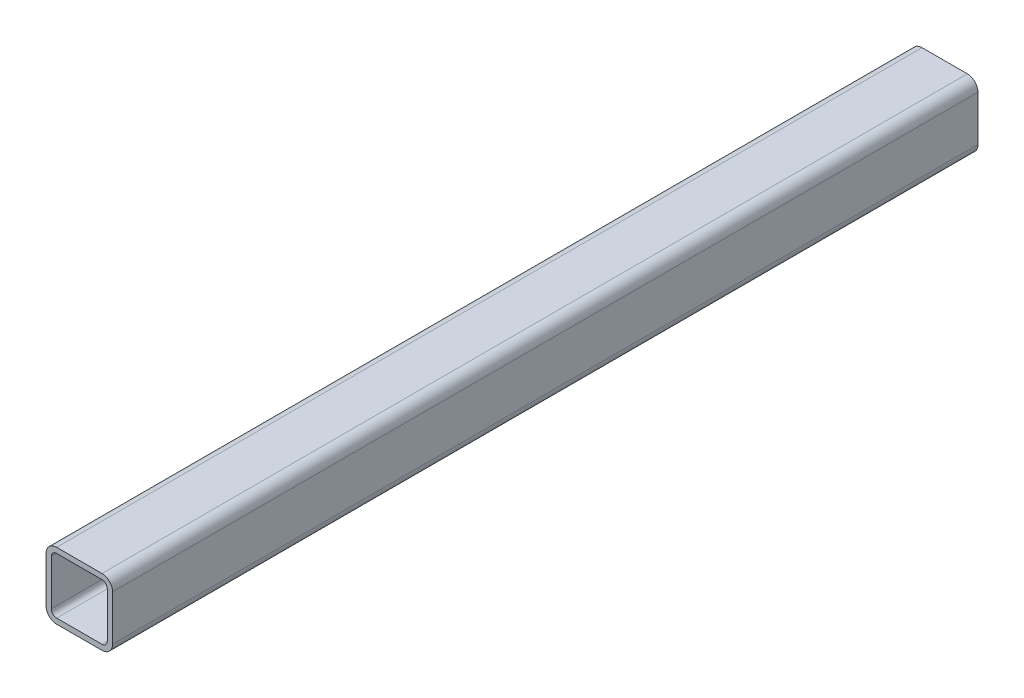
from build123d import *

# Parameters (mm, degrees)
EXTRUDE_THIN1_DEPTH = 247.65


with BuildPart() as part:
    # Sketch1 → Extrude-Thin1 (new, symmetric)
    with BuildSketch(Plane.XY):
        with BuildLine():
            Line((-19.05, -12.97432), (-19.05, 12.97432))
            ThreePointArc((-19.05, 12.97432), (-17.270474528, 17.270474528), (-12.97432, 19.05))
            Line((-12.97432, 19.05), (12.97432, 19.05))
            ThreePointArc((12.97432, 19.05), (17.270474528, 17.270474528), (19.05, 12.97432))
            Line((19.05, 12.97432), (19.05, -12.97432))
            ThreePointArc((19.05, -12.97432), (17.270474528, -17.270474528), (12.97432, -19.05))
            Line((12.97432, -19.05), (-12.97432, -19.05))
            ThreePointArc((-12.97432, -19.05), (-17.270474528, -17.270474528), (-19.05, -12.97432))
        make_face()
        with BuildLine():
            Line((-16.01216, -12.97432), (-16.01216, 12.97432))
            ThreePointArc((-16.01216, 12.97432), (-15.122397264, 15.122397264), (-12.97432, 16.01216))
            Line((-12.97432, 16.01216), (12.97432, 16.01216))
            ThreePointArc((12.97432, 16.01216), (15.122397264, 15.122397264), (16.01216, 12.97432))
            Line((16.01216, 12.97432), (16.01216, -12.97432))
            ThreePointArc((16.01216, -12.97432), (15.122397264, -15.122397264), (12.97432, -16.01216))
            Line((12.97432, -16.01216), (-12.97432, -16.01216))
            ThreePointArc((-12.97432, -16.01216), (-15.122397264, -15.122397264), (-16.01216, -12.97432))
        make_face(mode=Mode.SUBTRACT)
    extrude(amount=EXTRUDE_THIN1_DEPTH, both=True)


solid = part.part
